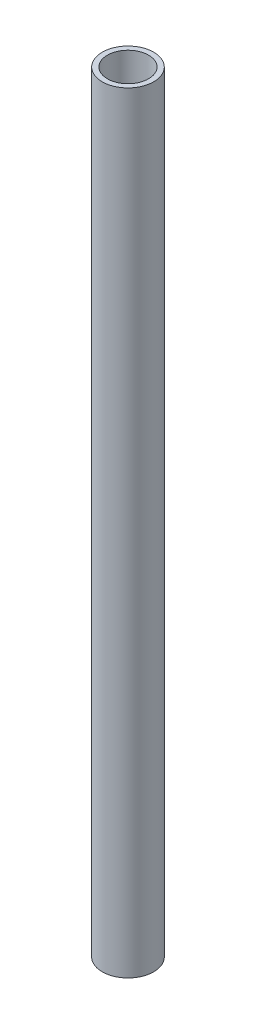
ISO-10303-21;
HEADER;
FILE_DESCRIPTION(('STEP AP214'),'2;1');
FILE_NAME('part.step','',(''),(''),'','','');
FILE_SCHEMA(('AUTOMOTIVE_DESIGN { 1 0 10303 214 1 1 1 1 }'));
ENDSEC;
DATA;
#1=APPLICATION_CONTEXT('core data for automotive mechanical design processes');
#2=APPLICATION_PROTOCOL_DEFINITION('international standard','automotive_design',2000,#1);
#3=PRODUCT_CONTEXT('',#1,'mechanical');
#4=PRODUCT('Part','Part','',(#3));
#5=PRODUCT_RELATED_PRODUCT_CATEGORY('part','',(#4));
#6=PRODUCT_DEFINITION_FORMATION('','',#4);
#7=PRODUCT_DEFINITION_CONTEXT('part definition',#1,'design');
#8=PRODUCT_DEFINITION('design','',#6,#7);
#9=PRODUCT_DEFINITION_SHAPE('','',#8);
#10=(LENGTH_UNIT() NAMED_UNIT(*) SI_UNIT(.MILLI.,.METRE.));
#11=(NAMED_UNIT(*) PLANE_ANGLE_UNIT() SI_UNIT($,.RADIAN.));
#12=(NAMED_UNIT(*) SI_UNIT($,.STERADIAN.) SOLID_ANGLE_UNIT());
#13=UNCERTAINTY_MEASURE_WITH_UNIT(LENGTH_MEASURE(1.E-05),#10,'distance_accuracy_value','');
#14=(GEOMETRIC_REPRESENTATION_CONTEXT(3) GLOBAL_UNCERTAINTY_ASSIGNED_CONTEXT((#13)) GLOBAL_UNIT_ASSIGNED_CONTEXT((#10,
#11,#12)) REPRESENTATION_CONTEXT('',''));
#15=CARTESIAN_POINT('',(0.,0.,0.));
#16=DIRECTION('',(0.,0.,1.));
#17=DIRECTION('',(1.,0.,0.));
#18=AXIS2_PLACEMENT_3D('',#15,#16,#17);
#19=CARTESIAN_POINT('',(0.,150.,0.));
#20=DIRECTION('',(0.,1.,0.));
#21=DIRECTION('',(0.,0.,1.));
#22=AXIS2_PLACEMENT_3D('',#19,#20,#21);
#23=PLANE('',#22);
#24=CARTESIAN_POINT('',(0.,150.,0.));
#25=DIRECTION('',(0.,1.,0.));
#26=DIRECTION('',(0.,0.,1.));
#27=AXIS2_PLACEMENT_3D('',#24,#25,#26);
#28=CIRCLE('',#27,5.);
#29=CARTESIAN_POINT('',(0.,150.,5.));
#30=VERTEX_POINT('',#29);
#31=EDGE_CURVE('E10',#30,#30,#28,.T.);
#32=ORIENTED_EDGE('',*,*,#31,.T.);
#33=EDGE_LOOP('',(#32));
#34=FACE_BOUND('',#33,.T.);
#35=CARTESIAN_POINT('',(0.,150.,0.));
#36=DIRECTION('',(0.,1.,0.));
#37=DIRECTION('',(0.,0.,1.));
#38=AXIS2_PLACEMENT_3D('',#35,#36,#37);
#39=CIRCLE('',#38,4.);
#40=CARTESIAN_POINT('',(0.,150.,4.));
#41=VERTEX_POINT('',#40);
#42=EDGE_CURVE('E56',#41,#41,#39,.T.);
#43=ORIENTED_EDGE('',*,*,#42,.F.);
#44=EDGE_LOOP('',(#43));
#45=FACE_BOUND('',#44,.T.);
#46=ADVANCED_FACE('F43',(#34,#45),#23,.T.);
#47=CARTESIAN_POINT('',(0.,0.,0.));
#48=DIRECTION('',(0.,1.,0.));
#49=DIRECTION('',(0.,0.,1.));
#50=AXIS2_PLACEMENT_3D('',#47,#48,#49);
#51=PLANE('',#50);
#52=CARTESIAN_POINT('',(0.,0.,0.));
#53=DIRECTION('',(0.,1.,0.));
#54=DIRECTION('',(0.,0.,1.));
#55=AXIS2_PLACEMENT_3D('',#52,#53,#54);
#56=CIRCLE('',#55,5.);
#57=CARTESIAN_POINT('',(0.,0.,5.));
#58=VERTEX_POINT('',#57);
#59=EDGE_CURVE('E47',#58,#58,#56,.T.);
#60=ORIENTED_EDGE('',*,*,#59,.F.);
#61=EDGE_LOOP('',(#60));
#62=FACE_BOUND('',#61,.T.);
#63=CARTESIAN_POINT('',(0.,0.,0.));
#64=DIRECTION('',(0.,1.,0.));
#65=DIRECTION('',(0.,0.,1.));
#66=AXIS2_PLACEMENT_3D('',#63,#64,#65);
#67=CIRCLE('',#66,4.);
#68=CARTESIAN_POINT('',(0.,0.,4.));
#69=VERTEX_POINT('',#68);
#70=EDGE_CURVE('E58',#69,#69,#67,.T.);
#71=ORIENTED_EDGE('',*,*,#70,.T.);
#72=EDGE_LOOP('',(#71));
#73=FACE_BOUND('',#72,.T.);
#74=ADVANCED_FACE('F70',(#62,#73),#51,.F.);
#75=CARTESIAN_POINT('',(0.,150.,0.));
#76=DIRECTION('',(0.,-1.,0.));
#77=DIRECTION('',(0.,0.,-1.));
#78=AXIS2_PLACEMENT_3D('',#75,#76,#77);
#79=CYLINDRICAL_SURFACE('',#78,5.);
#80=ORIENTED_EDGE('',*,*,#31,.F.);
#81=EDGE_LOOP('',(#80));
#82=FACE_BOUND('',#81,.T.);
#83=ORIENTED_EDGE('',*,*,#59,.T.);
#84=EDGE_LOOP('',(#83));
#85=FACE_BOUND('',#84,.T.);
#86=ADVANCED_FACE('F45',(#82,#85),#79,.T.);
#87=CARTESIAN_POINT('',(0.,150.,0.));
#88=DIRECTION('',(0.,-1.,0.));
#89=DIRECTION('',(0.,0.,-1.));
#90=AXIS2_PLACEMENT_3D('',#87,#88,#89);
#91=CYLINDRICAL_SURFACE('',#90,4.);
#92=ORIENTED_EDGE('',*,*,#42,.T.);
#93=EDGE_LOOP('',(#92));
#94=FACE_BOUND('',#93,.T.);
#95=ORIENTED_EDGE('',*,*,#70,.F.);
#96=EDGE_LOOP('',(#95));
#97=FACE_BOUND('',#96,.T.);
#98=ADVANCED_FACE('F66',(#94,#97),#91,.F.);
#99=CLOSED_SHELL('',(#46,#74,#86,#98));
#100=MANIFOLD_SOLID_BREP('B2',#99);
#101=ADVANCED_BREP_SHAPE_REPRESENTATION('',(#18,#100),#14);
#102=SHAPE_DEFINITION_REPRESENTATION(#9,#101);
ENDSEC;
END-ISO-10303-21;
